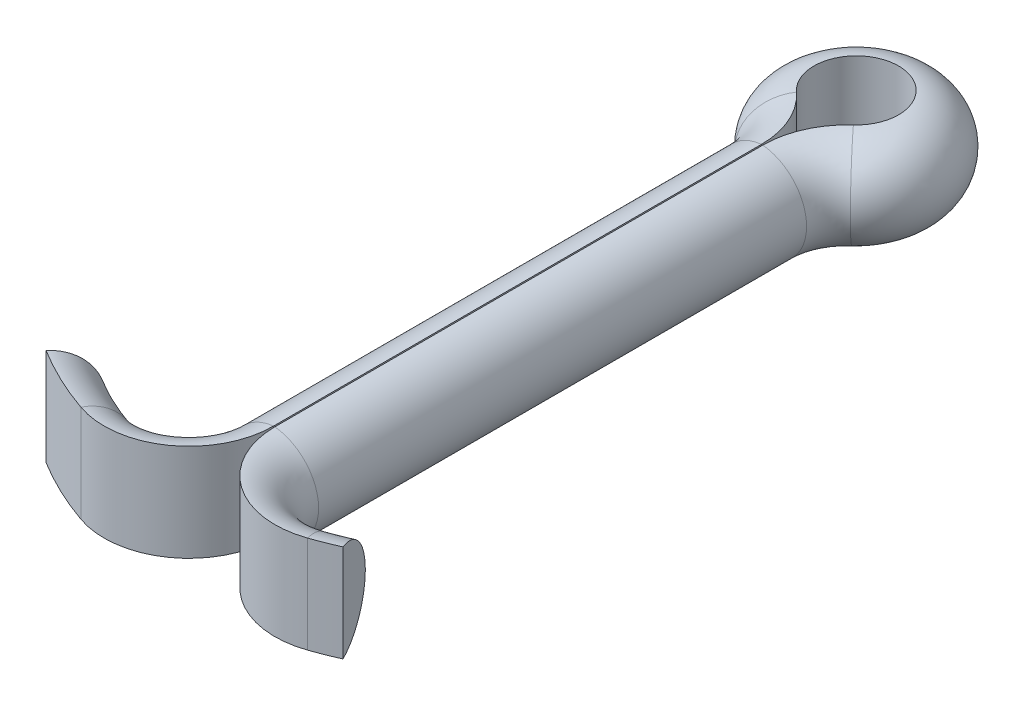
from build123d import *


with BuildPart() as part:
    # Sweep 2: sweep along a path in Sketch 1
    with BuildLine(Plane(origin=(0, 0, 0), x_dir=(1, 0, 0), z_dir=(0, 1, 0))) as sweep_2_path:
        ThreePointArc((2.599558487, -5.882670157), (2.363958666, -5.981238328), (2.124631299, -6.070375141))
        ThreePointArc((2.124631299, -6.070375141), (0.681608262, -5.866737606), (0.0127, -4.572))
        Line((0.0127, -4.572), (0.0127, 4.571982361))
        ThreePointArc((0.0127, 4.571982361), (0.14870056, 5.214870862), (0.5334, 5.747607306))
        ThreePointArc((0.5334, 5.747607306), (0, 7.129169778), (-0.5334, 5.747607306))
        ThreePointArc((-0.5334, 5.747607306), (-0.14870056, 5.214870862), (-0.0127, 4.571982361))
        Line((-0.0127, 4.571982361), (-0.0127, -4.572))
        ThreePointArc((-0.0127, -4.572), (-0.681608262, -5.866737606), (-2.124631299, -6.070375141))
        ThreePointArc((-2.124631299, -6.070375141), (-2.763976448, -5.807232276), (-3.37138044, -5.476979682))
    # Sketch 2 → Sweep 2 (sweep)
    with BuildSketch(Plane(origin=(-3.37138044, 0, 5.476979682), x_dir=(-0.5242024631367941, 0, 0.8515936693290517), z_dir=(-0.8515936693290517, 0, -0.5242024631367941))):
        with BuildLine():
            Line((0, -0.909444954), (0, 0.909444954))
            ThreePointArc((0, 0.909444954), (-0.819335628, 0), (0, -0.909444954))
        make_face()
    sweep(path=sweep_2_path.line)


solid = part.part
